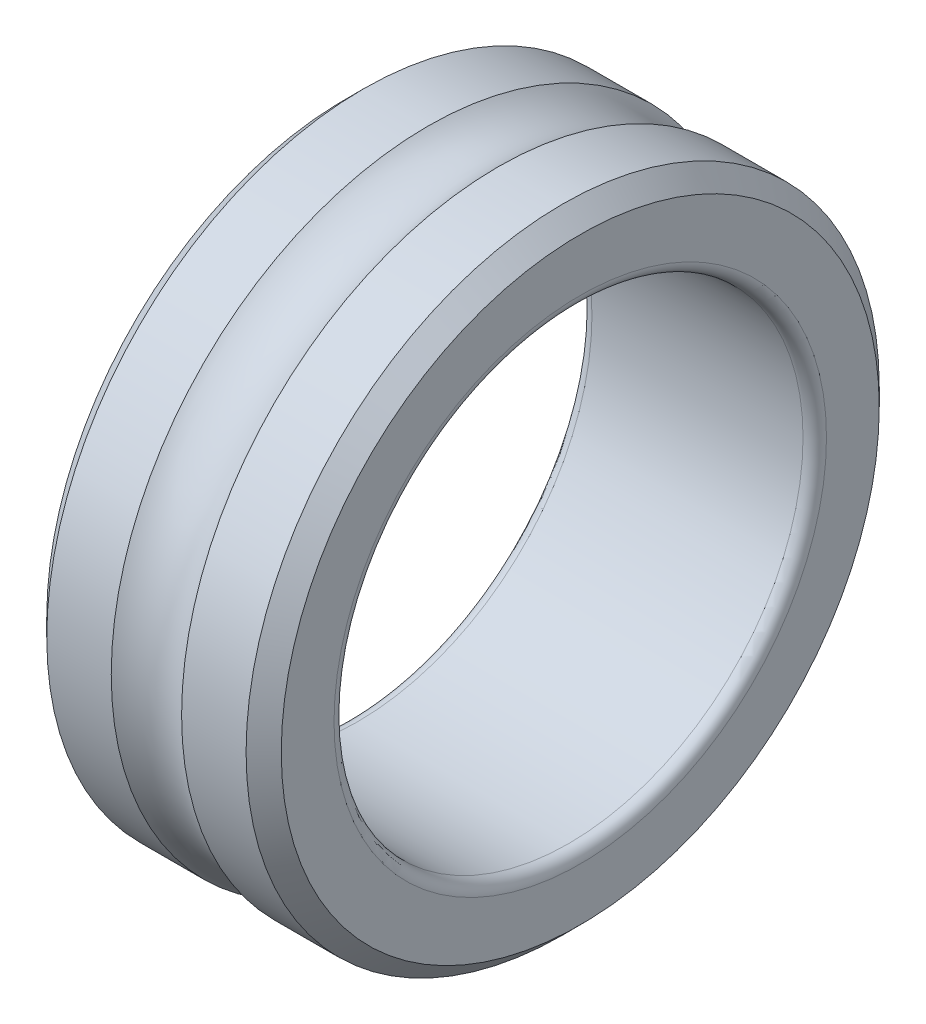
from build123d import *

# Parameters (mm, degrees)
CHANFREIN1_SIZE = 0.75


with BuildPart() as part:
    # Esquisse1 → Base-R_volution (revolve)
    with BuildSketch(Plane.XY, mode=Mode.PRIVATE) as base_r_volution_sk:
        with BuildLine():
            Line((-4.5, 10), (4.5, 10))
            ThreePointArc((4.5, 10), (4.853553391, 10.146446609), (5, 10.5))
            Line((5, 10.5), (5, 13.5))
            Line((5, 13.5), (1.5, 13.5))
            ThreePointArc((1.5, 13.5), (0, 13), (-1.5, 13.5))
            Line((-1.5, 13.5), (-5, 13.5))
            Line((-5, 13.5), (-5, 10.5))
            ThreePointArc((-5, 10.5), (-4.853553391, 10.146446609), (-4.5, 10))
        make_face()
    revolve(base_r_volution_sk.sketch.rotate(Axis((-6.833546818, 0, 0), (1, 0, 0)), 90), axis=Axis((-6.833546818, 0, 0), (1, 0, 0)))

    # Chanfrein1
    chanfrein1_edges = [part.edges().sort_by_distance(p)[0] for p in [
        (5, 0, -13.5),
        (-5, 0, -13.5),
    ]]
    chamfer(chanfrein1_edges, length=CHANFREIN1_SIZE)


solid = part.part
